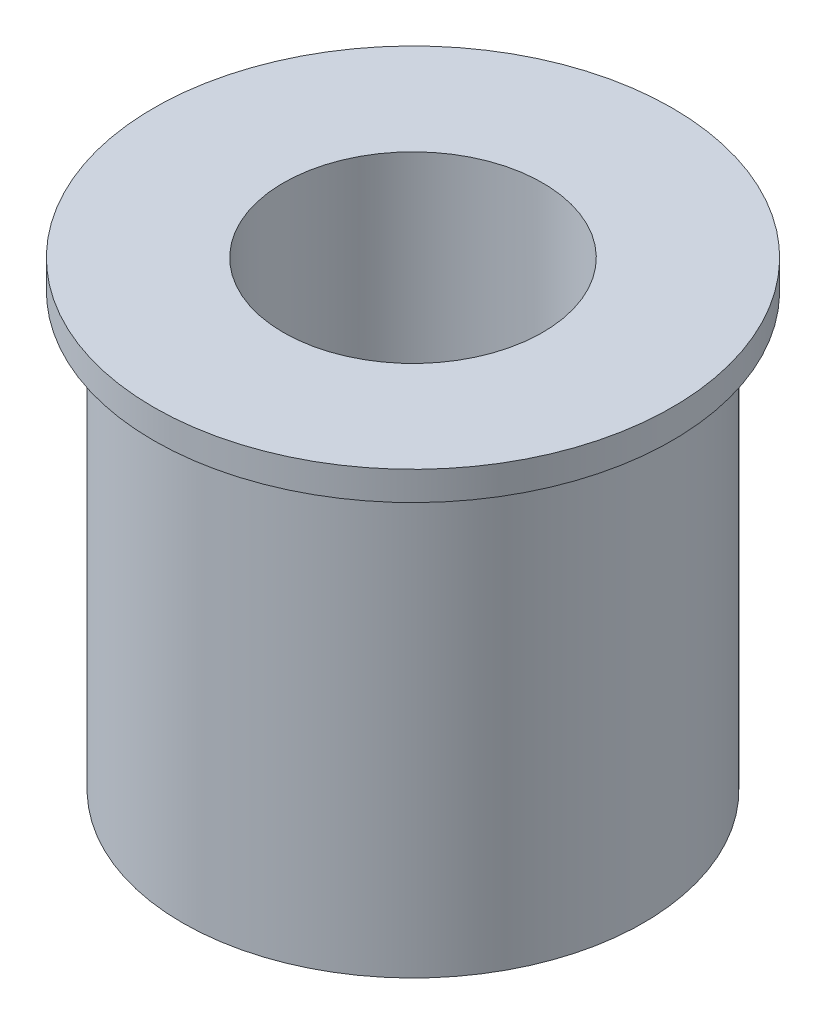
ISO-10303-21;
HEADER;
FILE_DESCRIPTION(('STEP AP214'),'2;1');
FILE_NAME('part.step','',(''),(''),'','','');
FILE_SCHEMA(('AUTOMOTIVE_DESIGN { 1 0 10303 214 1 1 1 1 }'));
ENDSEC;
DATA;
#1=APPLICATION_CONTEXT('core data for automotive mechanical design processes');
#2=APPLICATION_PROTOCOL_DEFINITION('international standard','automotive_design',2000,#1);
#3=PRODUCT_CONTEXT('',#1,'mechanical');
#4=PRODUCT('Part','Part','',(#3));
#5=PRODUCT_RELATED_PRODUCT_CATEGORY('part','',(#4));
#6=PRODUCT_DEFINITION_FORMATION('','',#4);
#7=PRODUCT_DEFINITION_CONTEXT('part definition',#1,'design');
#8=PRODUCT_DEFINITION('design','',#6,#7);
#9=PRODUCT_DEFINITION_SHAPE('','',#8);
#10=(LENGTH_UNIT() NAMED_UNIT(*) SI_UNIT(.MILLI.,.METRE.));
#11=(NAMED_UNIT(*) PLANE_ANGLE_UNIT() SI_UNIT($,.RADIAN.));
#12=(NAMED_UNIT(*) SI_UNIT($,.STERADIAN.) SOLID_ANGLE_UNIT());
#13=UNCERTAINTY_MEASURE_WITH_UNIT(LENGTH_MEASURE(1.E-05),#10,'distance_accuracy_value','');
#14=(GEOMETRIC_REPRESENTATION_CONTEXT(3) GLOBAL_UNCERTAINTY_ASSIGNED_CONTEXT((#13)) GLOBAL_UNIT_ASSIGNED_CONTEXT((#10,
#11,#12)) REPRESENTATION_CONTEXT('',''));
#15=CARTESIAN_POINT('',(0.,0.,0.));
#16=DIRECTION('',(0.,0.,1.));
#17=DIRECTION('',(1.,0.,0.));
#18=AXIS2_PLACEMENT_3D('',#15,#16,#17);
#19=CARTESIAN_POINT('',(0.,48.2734240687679,0.));
#20=DIRECTION('',(0.,1.,0.));
#21=DIRECTION('',(0.,0.,1.));
#22=AXIS2_PLACEMENT_3D('',#19,#20,#21);
#23=CYLINDRICAL_SURFACE('',#22,4.5);
#24=CARTESIAN_POINT('',(0.,-0.41795172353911,0.));
#25=DIRECTION('',(0.,1.,0.));
#26=DIRECTION('',(0.,0.,1.));
#27=AXIS2_PLACEMENT_3D('',#24,#25,#26);
#28=CIRCLE('',#27,4.5);
#29=CARTESIAN_POINT('',(0.,-0.41795172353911,4.5));
#30=VERTEX_POINT('',#29);
#31=EDGE_CURVE('E62',#30,#30,#28,.T.);
#32=ORIENTED_EDGE('',*,*,#31,.F.);
#33=EDGE_LOOP('',(#32));
#34=FACE_BOUND('',#33,.T.);
#35=CARTESIAN_POINT('',(0.,1.58204827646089,0.));
#36=DIRECTION('',(0.,1.,0.));
#37=DIRECTION('',(-1.,0.,0.));
#38=AXIS2_PLACEMENT_3D('',#35,#36,#37);
#39=CIRCLE('',#38,4.5);
#40=CARTESIAN_POINT('',(-4.5,1.58204827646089,0.));
#41=VERTEX_POINT('',#40);
#42=EDGE_CURVE('E88',#41,#41,#39,.F.);
#43=ORIENTED_EDGE('',*,*,#42,.F.);
#44=EDGE_LOOP('',(#43));
#45=FACE_BOUND('',#44,.T.);
#46=ADVANCED_FACE('F30',(#34,#45),#23,.F.);
#47=CARTESIAN_POINT('',(0.,15.5820482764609,0.));
#48=DIRECTION('',(0.,1.,0.));
#49=DIRECTION('',(0.,0.,1.));
#50=AXIS2_PLACEMENT_3D('',#47,#48,#49);
#51=CIRCLE('',#50,4.5);
#52=CARTESIAN_POINT('',(0.,15.5820482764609,4.5));
#53=VERTEX_POINT('',#52);
#54=EDGE_CURVE('E73',#53,#53,#51,.T.);
#55=ORIENTED_EDGE('',*,*,#54,.T.);
#56=EDGE_LOOP('',(#55));
#57=FACE_BOUND('',#56,.T.);
#58=CARTESIAN_POINT('',(0.,4.58204827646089,0.));
#59=DIRECTION('',(0.,-1.,0.));
#60=DIRECTION('',(1.,0.,0.));
#61=AXIS2_PLACEMENT_3D('',#58,#59,#60);
#62=CIRCLE('',#61,4.5);
#63=CARTESIAN_POINT('',(4.5,4.58204827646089,0.));
#64=VERTEX_POINT('',#63);
#65=EDGE_CURVE('E91',#64,#64,#62,.F.);
#66=ORIENTED_EDGE('',*,*,#65,.F.);
#67=EDGE_LOOP('',(#66));
#68=FACE_BOUND('',#67,.T.);
#69=ADVANCED_FACE('F103',(#57,#68),#23,.F.);
#70=CARTESIAN_POINT('',(0.,48.2734240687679,0.));
#71=DIRECTION('',(0.,1.,0.));
#72=DIRECTION('',(0.,0.,1.));
#73=AXIS2_PLACEMENT_3D('',#70,#71,#72);
#74=CYLINDRICAL_SURFACE('',#73,8.00000000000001);
#75=CARTESIAN_POINT('',(0.,-0.41795172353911,0.));
#76=DIRECTION('',(0.,1.,0.));
#77=DIRECTION('',(0.,0.,1.));
#78=AXIS2_PLACEMENT_3D('',#75,#76,#77);
#79=CIRCLE('',#78,8.00000000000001);
#80=CARTESIAN_POINT('',(0.,-0.41795172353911,8.00000000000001));
#81=VERTEX_POINT('',#80);
#82=EDGE_CURVE('E85',#81,#81,#79,.T.);
#83=ORIENTED_EDGE('',*,*,#82,.T.);
#84=EDGE_LOOP('',(#83));
#85=FACE_BOUND('',#84,.T.);
#86=CARTESIAN_POINT('',(0.,14.5820482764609,0.));
#87=DIRECTION('',(0.,1.,0.));
#88=DIRECTION('',(0.,0.,1.));
#89=AXIS2_PLACEMENT_3D('',#86,#87,#88);
#90=CIRCLE('',#89,8.00000000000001);
#91=CARTESIAN_POINT('',(0.,14.5820482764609,8.00000000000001));
#92=VERTEX_POINT('',#91);
#93=EDGE_CURVE('E82',#92,#92,#90,.T.);
#94=ORIENTED_EDGE('',*,*,#93,.F.);
#95=EDGE_LOOP('',(#94));
#96=FACE_BOUND('',#95,.T.);
#97=CARTESIAN_POINT('',(0.,1.58204827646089,0.));
#98=DIRECTION('',(0.,1.,0.));
#99=DIRECTION('',(-1.,0.,0.));
#100=AXIS2_PLACEMENT_3D('',#97,#98,#99);
#101=CIRCLE('',#100,8.00000000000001);
#102=CARTESIAN_POINT('',(-7.90326666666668,1.58204827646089,-1.24031286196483));
#103=VERTEX_POINT('',#102);
#104=CARTESIAN_POINT('',(-7.90326666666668,1.58204827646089,1.24031286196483));
#105=VERTEX_POINT('',#104);
#106=EDGE_CURVE('E11',#103,#105,#101,.T.);
#107=ORIENTED_EDGE('',*,*,#106,.F.);
#108=DIRECTION('',(0.,1.,0.));
#109=VECTOR('',#108,1.);
#110=CARTESIAN_POINT('',(-7.90326666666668,3.08204827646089,-1.24031286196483));
#111=LINE('',#110,#109);
#112=CARTESIAN_POINT('',(-7.90326666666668,4.58204827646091,-1.24031286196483));
#113=VERTEX_POINT('',#112);
#114=EDGE_CURVE('E51',#113,#103,#111,.F.);
#115=ORIENTED_EDGE('',*,*,#114,.F.);
#116=CARTESIAN_POINT('',(0.,4.58204827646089,0.));
#117=DIRECTION('',(0.,-1.,0.));
#118=DIRECTION('',(1.,0.,0.));
#119=AXIS2_PLACEMENT_3D('',#116,#117,#118);
#120=CIRCLE('',#119,8.00000000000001);
#121=CARTESIAN_POINT('',(-7.90326666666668,4.58204827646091,1.24031286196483));
#122=VERTEX_POINT('',#121);
#123=EDGE_CURVE('E57',#122,#113,#120,.T.);
#124=ORIENTED_EDGE('',*,*,#123,.F.);
#125=DIRECTION('',(0.,1.,0.));
#126=VECTOR('',#125,1.);
#127=CARTESIAN_POINT('',(-7.90326666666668,3.08204827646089,1.24031286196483));
#128=LINE('',#127,#126);
#129=EDGE_CURVE('E38',#105,#122,#128,.T.);
#130=ORIENTED_EDGE('',*,*,#129,.F.);
#131=EDGE_LOOP('',(#107,#115,#124,#130));
#132=FACE_BOUND('',#131,.T.);
#133=ADVANCED_FACE('F68',(#85,#96,#132),#74,.T.);
#134=CARTESIAN_POINT('',(8.00000000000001,-0.417951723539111,0.));
#135=DIRECTION('',(0.,1.,0.));
#136=DIRECTION('',(0.,0.,1.));
#137=AXIS2_PLACEMENT_3D('',#134,#135,#136);
#138=PLANE('',#137);
#139=ORIENTED_EDGE('',*,*,#82,.F.);
#140=EDGE_LOOP('',(#139));
#141=FACE_BOUND('',#140,.T.);
#142=ORIENTED_EDGE('',*,*,#31,.T.);
#143=EDGE_LOOP('',(#142));
#144=FACE_BOUND('',#143,.T.);
#145=ADVANCED_FACE('F32',(#141,#144),#138,.F.);
#146=CARTESIAN_POINT('',(4.5,15.5820482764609,0.));
#147=DIRECTION('',(0.,-1.,0.));
#148=DIRECTION('',(0.,0.,-1.));
#149=AXIS2_PLACEMENT_3D('',#146,#147,#148);
#150=PLANE('',#149);
#151=ORIENTED_EDGE('',*,*,#54,.F.);
#152=EDGE_LOOP('',(#151));
#153=FACE_BOUND('',#152,.T.);
#154=CARTESIAN_POINT('',(0.,15.5820482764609,0.));
#155=DIRECTION('',(0.,1.,0.));
#156=DIRECTION('',(0.,0.,1.));
#157=AXIS2_PLACEMENT_3D('',#154,#155,#156);
#158=CIRCLE('',#157,9.);
#159=CARTESIAN_POINT('',(0.,15.5820482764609,9.));
#160=VERTEX_POINT('',#159);
#161=EDGE_CURVE('E76',#160,#160,#158,.T.);
#162=ORIENTED_EDGE('',*,*,#161,.T.);
#163=EDGE_LOOP('',(#162));
#164=FACE_BOUND('',#163,.T.);
#165=ADVANCED_FACE('F111',(#153,#164),#150,.F.);
#166=CARTESIAN_POINT('',(0.,48.2734240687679,0.));
#167=DIRECTION('',(0.,1.,0.));
#168=DIRECTION('',(0.,0.,1.));
#169=AXIS2_PLACEMENT_3D('',#166,#167,#168);
#170=CYLINDRICAL_SURFACE('',#169,9.00000000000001);
#171=ORIENTED_EDGE('',*,*,#161,.F.);
#172=EDGE_LOOP('',(#171));
#173=FACE_BOUND('',#172,.T.);
#174=CARTESIAN_POINT('',(0.,14.5820482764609,0.));
#175=DIRECTION('',(0.,1.,0.));
#176=DIRECTION('',(0.,0.,1.));
#177=AXIS2_PLACEMENT_3D('',#174,#175,#176);
#178=CIRCLE('',#177,9.00000000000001);
#179=CARTESIAN_POINT('',(0.,14.5820482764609,9.00000000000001));
#180=VERTEX_POINT('',#179);
#181=EDGE_CURVE('E79',#180,#180,#178,.T.);
#182=ORIENTED_EDGE('',*,*,#181,.T.);
#183=EDGE_LOOP('',(#182));
#184=FACE_BOUND('',#183,.T.);
#185=ADVANCED_FACE('F114',(#173,#184),#170,.T.);
#186=CARTESIAN_POINT('',(9.00000000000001,14.5820482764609,0.));
#187=DIRECTION('',(0.,1.,0.));
#188=DIRECTION('',(0.,0.,1.));
#189=AXIS2_PLACEMENT_3D('',#186,#187,#188);
#190=PLANE('',#189);
#191=ORIENTED_EDGE('',*,*,#181,.F.);
#192=EDGE_LOOP('',(#191));
#193=FACE_BOUND('',#192,.T.);
#194=ORIENTED_EDGE('',*,*,#93,.T.);
#195=EDGE_LOOP('',(#194));
#196=FACE_BOUND('',#195,.T.);
#197=ADVANCED_FACE('F98',(#193,#196),#190,.F.);
#198=CARTESIAN_POINT('',(-0.750000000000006,1.58204827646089,0.));
#199=DIRECTION('',(0.,1.,0.));
#200=DIRECTION('',(-1.,0.,0.));
#201=AXIS2_PLACEMENT_3D('',#198,#199,#200);
#202=PLANE('',#201);
#203=ORIENTED_EDGE('',*,*,#106,.T.);
#204=CARTESIAN_POINT('',(-0.750000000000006,1.58204827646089,0.));
#205=DIRECTION('',(0.,1.,0.));
#206=DIRECTION('',(-1.,0.,0.));
#207=AXIS2_PLACEMENT_3D('',#204,#205,#206);
#208=CIRCLE('',#207,7.26);
#209=EDGE_CURVE('E65',#105,#103,#208,.T.);
#210=ORIENTED_EDGE('',*,*,#209,.T.);
#211=EDGE_LOOP('',(#203,#210));
#212=FACE_BOUND('',#211,.T.);
#213=ORIENTED_EDGE('',*,*,#42,.T.);
#214=EDGE_LOOP('',(#213));
#215=FACE_BOUND('',#214,.T.);
#216=ADVANCED_FACE('F95',(#212,#215),#202,.T.);
#217=CARTESIAN_POINT('',(-0.750000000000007,8.95740644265,0.));
#218=DIRECTION('',(0.,1.,0.));
#219=DIRECTION('',(-1.,0.,0.));
#220=AXIS2_PLACEMENT_3D('',#217,#218,#219);
#221=CYLINDRICAL_SURFACE('',#220,7.26);
#222=ORIENTED_EDGE('',*,*,#129,.T.);
#223=CARTESIAN_POINT('',(-0.750000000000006,4.58204827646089,0.));
#224=DIRECTION('',(0.,1.,0.));
#225=DIRECTION('',(-1.,0.,0.));
#226=AXIS2_PLACEMENT_3D('',#223,#224,#225);
#227=CIRCLE('',#226,7.26);
#228=EDGE_CURVE('E44',#122,#113,#227,.T.);
#229=ORIENTED_EDGE('',*,*,#228,.T.);
#230=ORIENTED_EDGE('',*,*,#114,.T.);
#231=ORIENTED_EDGE('',*,*,#209,.F.);
#232=EDGE_LOOP('',(#222,#229,#230,#231));
#233=FACE_BOUND('',#232,.T.);
#234=ADVANCED_FACE('F64',(#233),#221,.F.);
#235=CARTESIAN_POINT('',(-0.750000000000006,4.58204827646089,0.));
#236=DIRECTION('',(0.,-1.,0.));
#237=DIRECTION('',(1.,0.,0.));
#238=AXIS2_PLACEMENT_3D('',#235,#236,#237);
#239=PLANE('',#238);
#240=ORIENTED_EDGE('',*,*,#123,.T.);
#241=ORIENTED_EDGE('',*,*,#228,.F.);
#242=EDGE_LOOP('',(#240,#241));
#243=FACE_BOUND('',#242,.T.);
#244=ORIENTED_EDGE('',*,*,#65,.T.);
#245=EDGE_LOOP('',(#244));
#246=FACE_BOUND('',#245,.T.);
#247=ADVANCED_FACE('F58',(#243,#246),#239,.T.);
#248=CLOSED_SHELL('',(#46,#69,#133,#145,#165,#185,#197,#216,#234,#247));
#249=MANIFOLD_SOLID_BREP('B2',#248);
#250=ADVANCED_BREP_SHAPE_REPRESENTATION('',(#18,#249),#14);
#251=SHAPE_DEFINITION_REPRESENTATION(#9,#250);
ENDSEC;
END-ISO-10303-21;
